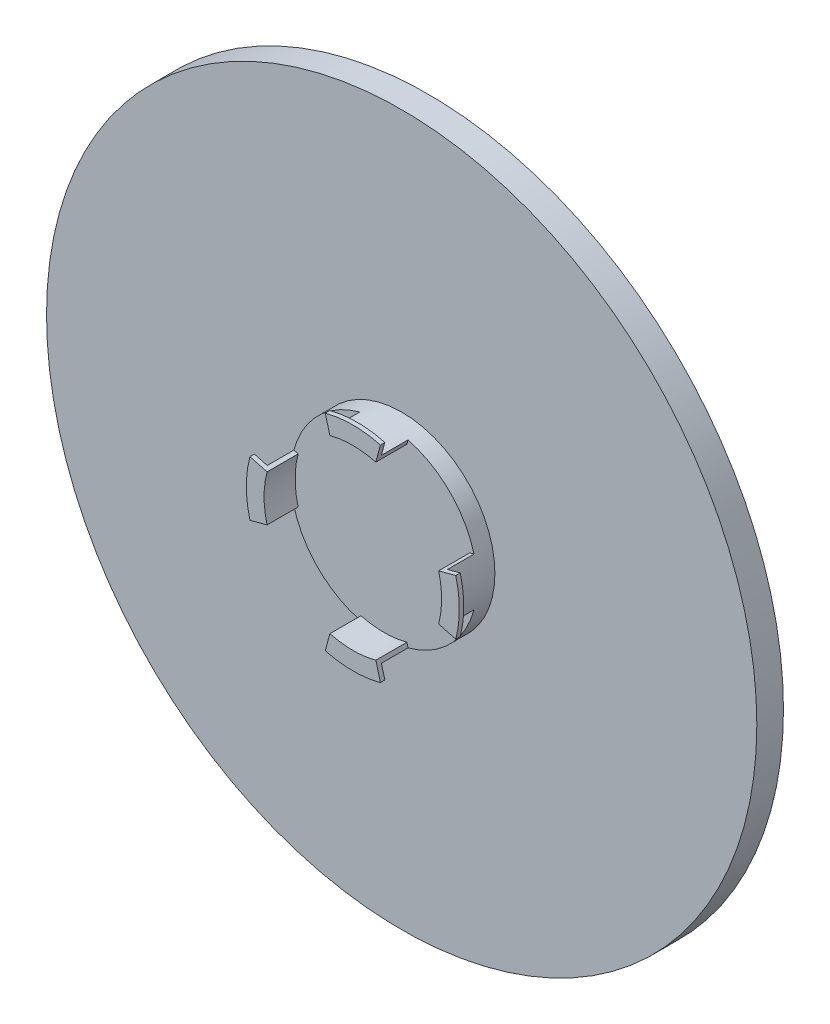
ISO-10303-21;
HEADER;
FILE_DESCRIPTION(('STEP AP214'),'2;1');
FILE_NAME('part.step','',(''),(''),'','','');
FILE_SCHEMA(('AUTOMOTIVE_DESIGN { 1 0 10303 214 1 1 1 1 }'));
ENDSEC;
DATA;
#1=APPLICATION_CONTEXT('core data for automotive mechanical design processes');
#2=APPLICATION_PROTOCOL_DEFINITION('international standard','automotive_design',2000,#1);
#3=PRODUCT_CONTEXT('',#1,'mechanical');
#4=PRODUCT('Part','Part','',(#3));
#5=PRODUCT_RELATED_PRODUCT_CATEGORY('part','',(#4));
#6=PRODUCT_DEFINITION_FORMATION('','',#4);
#7=PRODUCT_DEFINITION_CONTEXT('part definition',#1,'design');
#8=PRODUCT_DEFINITION('design','',#6,#7);
#9=PRODUCT_DEFINITION_SHAPE('','',#8);
#10=(LENGTH_UNIT() NAMED_UNIT(*) SI_UNIT(.MILLI.,.METRE.));
#11=(NAMED_UNIT(*) PLANE_ANGLE_UNIT() SI_UNIT($,.RADIAN.));
#12=(NAMED_UNIT(*) SI_UNIT($,.STERADIAN.) SOLID_ANGLE_UNIT());
#13=UNCERTAINTY_MEASURE_WITH_UNIT(LENGTH_MEASURE(1.E-05),#10,'distance_accuracy_value','');
#14=(GEOMETRIC_REPRESENTATION_CONTEXT(3) GLOBAL_UNCERTAINTY_ASSIGNED_CONTEXT((#13)) GLOBAL_UNIT_ASSIGNED_CONTEXT((#10,
#11,#12)) REPRESENTATION_CONTEXT('',''));
#15=CARTESIAN_POINT('',(0.,0.,0.));
#16=DIRECTION('',(0.,0.,1.));
#17=DIRECTION('',(1.,0.,0.));
#18=AXIS2_PLACEMENT_3D('',#15,#16,#17);
#19=CARTESIAN_POINT('',(0.,0.,50.));
#20=DIRECTION('',(0.,0.,1.));
#21=DIRECTION('',(1.,0.,0.));
#22=AXIS2_PLACEMENT_3D('',#19,#20,#21);
#23=PLANE('',#22);
#24=CARTESIAN_POINT('',(0.,0.,50.));
#25=DIRECTION('',(0.,0.,-1.));
#26=DIRECTION('',(1.,0.,0.));
#27=AXIS2_PLACEMENT_3D('',#24,#25,#26);
#28=CIRCLE('',#27,100.);
#29=CARTESIAN_POINT('',(25.8819045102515,-96.592582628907,50.));
#30=VERTEX_POINT('',#29);
#31=CARTESIAN_POINT('',(-25.8819045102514,-96.592582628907,50.));
#32=VERTEX_POINT('',#31);
#33=EDGE_CURVE('E48',#30,#32,#28,.T.);
#34=ORIENTED_EDGE('',*,*,#33,.F.);
#35=DIRECTION('',(-0.258819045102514,0.96592582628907,0.));
#36=VECTOR('',#35,1.);
#37=CARTESIAN_POINT('',(25.8819045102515,-96.592582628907,50.));
#38=LINE('',#37,#36);
#39=CARTESIAN_POINT('',(27.1759997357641,-101.422211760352,50.));
#40=VERTEX_POINT('',#39);
#41=EDGE_CURVE('E300',#40,#30,#38,.T.);
#42=ORIENTED_EDGE('',*,*,#41,.F.);
#43=CARTESIAN_POINT('',(0.,0.,50.));
#44=DIRECTION('',(0.,0.,1.));
#45=DIRECTION('',(1.,0.,0.));
#46=AXIS2_PLACEMENT_3D('',#43,#44,#45);
#47=CIRCLE('',#46,105.);
#48=CARTESIAN_POINT('',(101.422211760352,-27.1759997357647,50.));
#49=VERTEX_POINT('',#48);
#50=EDGE_CURVE('E34',#40,#49,#47,.T.);
#51=ORIENTED_EDGE('',*,*,#50,.T.);
#52=DIRECTION('',(0.965925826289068,-0.258819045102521,0.));
#53=VECTOR('',#52,1.);
#54=CARTESIAN_POINT('',(96.5925826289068,-25.8819045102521,50.));
#55=LINE('',#54,#53);
#56=CARTESIAN_POINT('',(96.5925826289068,-25.8819045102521,50.));
#57=VERTEX_POINT('',#56);
#58=EDGE_CURVE('E318',#57,#49,#55,.T.);
#59=ORIENTED_EDGE('',*,*,#58,.F.);
#60=CARTESIAN_POINT('',(0.,0.,50.));
#61=DIRECTION('',(0.,0.,-1.));
#62=DIRECTION('',(1.,0.,0.));
#63=AXIS2_PLACEMENT_3D('',#60,#61,#62);
#64=CIRCLE('',#63,100.);
#65=CARTESIAN_POINT('',(96.5925826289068,25.8819045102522,50.));
#66=VERTEX_POINT('',#65);
#67=EDGE_CURVE('E321',#66,#57,#64,.T.);
#68=ORIENTED_EDGE('',*,*,#67,.F.);
#69=DIRECTION('',(-0.965925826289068,-0.258819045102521,0.));
#70=VECTOR('',#69,1.);
#71=CARTESIAN_POINT('',(96.5925826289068,25.8819045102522,50.));
#72=LINE('',#71,#70);
#73=CARTESIAN_POINT('',(101.422211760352,27.1759997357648,50.));
#74=VERTEX_POINT('',#73);
#75=EDGE_CURVE('E313',#74,#66,#72,.T.);
#76=ORIENTED_EDGE('',*,*,#75,.F.);
#77=CARTESIAN_POINT('',(27.1759997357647,101.422211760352,50.));
#78=VERTEX_POINT('',#77);
#79=EDGE_CURVE('E391',#74,#78,#47,.T.);
#80=ORIENTED_EDGE('',*,*,#79,.T.);
#81=DIRECTION('',(0.258819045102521,0.965925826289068,0.));
#82=VECTOR('',#81,1.);
#83=CARTESIAN_POINT('',(25.8819045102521,96.5925826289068,50.));
#84=LINE('',#83,#82);
#85=CARTESIAN_POINT('',(25.8819045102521,96.5925826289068,50.));
#86=VERTEX_POINT('',#85);
#87=EDGE_CURVE('E342',#86,#78,#84,.T.);
#88=ORIENTED_EDGE('',*,*,#87,.F.);
#89=CARTESIAN_POINT('',(0.,0.,50.));
#90=DIRECTION('',(0.,0.,-1.));
#91=DIRECTION('',(1.,0.,0.));
#92=AXIS2_PLACEMENT_3D('',#89,#90,#91);
#93=CIRCLE('',#92,100.);
#94=CARTESIAN_POINT('',(-25.8819045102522,96.5925826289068,50.));
#95=VERTEX_POINT('',#94);
#96=EDGE_CURVE('E344',#95,#86,#93,.T.);
#97=ORIENTED_EDGE('',*,*,#96,.F.);
#98=DIRECTION('',(0.258819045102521,-0.965925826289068,0.));
#99=VECTOR('',#98,1.);
#100=CARTESIAN_POINT('',(-25.8819045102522,96.5925826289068,50.));
#101=LINE('',#100,#99);
#102=CARTESIAN_POINT('',(-27.1759997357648,101.422211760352,50.));
#103=VERTEX_POINT('',#102);
#104=EDGE_CURVE('E337',#103,#95,#101,.T.);
#105=ORIENTED_EDGE('',*,*,#104,.F.);
#106=CARTESIAN_POINT('',(-101.422211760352,27.175999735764,50.));
#107=VERTEX_POINT('',#106);
#108=EDGE_CURVE('E390',#103,#107,#47,.T.);
#109=ORIENTED_EDGE('',*,*,#108,.T.);
#110=DIRECTION('',(-0.96592582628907,0.258819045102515,0.));
#111=VECTOR('',#110,1.);
#112=CARTESIAN_POINT('',(-96.592582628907,25.8819045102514,50.));
#113=LINE('',#112,#111);
#114=CARTESIAN_POINT('',(-96.592582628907,25.8819045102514,50.));
#115=VERTEX_POINT('',#114);
#116=EDGE_CURVE('E366',#115,#107,#113,.T.);
#117=ORIENTED_EDGE('',*,*,#116,.F.);
#118=CARTESIAN_POINT('',(0.,0.,50.));
#119=DIRECTION('',(0.,0.,-1.));
#120=DIRECTION('',(1.,0.,0.));
#121=AXIS2_PLACEMENT_3D('',#118,#119,#120);
#122=CIRCLE('',#121,100.);
#123=CARTESIAN_POINT('',(-96.592582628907,-25.8819045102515,50.));
#124=VERTEX_POINT('',#123);
#125=EDGE_CURVE('E358',#124,#115,#122,.T.);
#126=ORIENTED_EDGE('',*,*,#125,.F.);
#127=DIRECTION('',(0.96592582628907,0.258819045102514,0.));
#128=VECTOR('',#127,1.);
#129=CARTESIAN_POINT('',(-96.592582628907,-25.8819045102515,50.));
#130=LINE('',#129,#128);
#131=CARTESIAN_POINT('',(-101.422211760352,-27.175999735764,50.));
#132=VERTEX_POINT('',#131);
#133=EDGE_CURVE('E363',#132,#124,#130,.T.);
#134=ORIENTED_EDGE('',*,*,#133,.F.);
#135=CARTESIAN_POINT('',(-27.175999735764,-101.422211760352,50.));
#136=VERTEX_POINT('',#135);
#137=EDGE_CURVE('E374',#132,#136,#47,.T.);
#138=ORIENTED_EDGE('',*,*,#137,.T.);
#139=DIRECTION('',(-0.258819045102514,-0.96592582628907,0.));
#140=VECTOR('',#139,1.);
#141=CARTESIAN_POINT('',(-25.8819045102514,-96.592582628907,50.));
#142=LINE('',#141,#140);
#143=EDGE_CURVE('E53',#32,#136,#142,.T.);
#144=ORIENTED_EDGE('',*,*,#143,.F.);
#145=EDGE_LOOP('',(#34,#42,#51,#59,#68,#76,#80,#88,#97,#105,#109,#117,#126,#134,#138,#144));
#146=FACE_BOUND('',#145,.T.);
#147=ADVANCED_FACE('F30',(#146),#23,.T.);
#148=CARTESIAN_POINT('',(0.,0.,30.));
#149=DIRECTION('',(0.,0.,1.));
#150=DIRECTION('',(1.,0.,0.));
#151=AXIS2_PLACEMENT_3D('',#148,#149,#150);
#152=PLANE('',#151);
#153=CARTESIAN_POINT('',(0.,0.,30.));
#154=DIRECTION('',(0.,0.,1.));
#155=DIRECTION('',(1.,0.,0.));
#156=AXIS2_PLACEMENT_3D('',#153,#154,#155);
#157=CIRCLE('',#156,400.);
#158=CARTESIAN_POINT('',(400.,0.,30.));
#159=VERTEX_POINT('',#158);
#160=EDGE_CURVE('E11',#159,#159,#157,.T.);
#161=ORIENTED_EDGE('',*,*,#160,.T.);
#162=EDGE_LOOP('',(#161));
#163=FACE_BOUND('',#162,.T.);
#164=CARTESIAN_POINT('',(0.,0.,30.));
#165=DIRECTION('',(0.,0.,1.));
#166=DIRECTION('',(1.,0.,0.));
#167=AXIS2_PLACEMENT_3D('',#164,#165,#166);
#168=CIRCLE('',#167,105.);
#169=CARTESIAN_POINT('',(105.,0.,30.));
#170=VERTEX_POINT('',#169);
#171=EDGE_CURVE('E392',#170,#170,#168,.T.);
#172=ORIENTED_EDGE('',*,*,#171,.F.);
#173=EDGE_LOOP('',(#172));
#174=FACE_BOUND('',#173,.T.);
#175=ADVANCED_FACE('F443',(#163,#174),#152,.T.);
#176=CARTESIAN_POINT('',(0.,0.,30.));
#177=DIRECTION('',(0.,0.,-1.));
#178=DIRECTION('',(-1.,0.,0.));
#179=AXIS2_PLACEMENT_3D('',#176,#177,#178);
#180=CYLINDRICAL_SURFACE('',#179,400.);
#181=ORIENTED_EDGE('',*,*,#160,.F.);
#182=EDGE_LOOP('',(#181));
#183=FACE_BOUND('',#182,.T.);
#184=CARTESIAN_POINT('',(0.,0.,0.));
#185=DIRECTION('',(0.,0.,1.));
#186=DIRECTION('',(1.,0.,0.));
#187=AXIS2_PLACEMENT_3D('',#184,#185,#186);
#188=CIRCLE('',#187,400.);
#189=CARTESIAN_POINT('',(400.,0.,0.));
#190=VERTEX_POINT('',#189);
#191=EDGE_CURVE('E40',#190,#190,#188,.T.);
#192=ORIENTED_EDGE('',*,*,#191,.T.);
#193=EDGE_LOOP('',(#192));
#194=FACE_BOUND('',#193,.T.);
#195=ADVANCED_FACE('F32',(#183,#194),#180,.T.);
#196=CARTESIAN_POINT('',(0.,0.,0.));
#197=DIRECTION('',(0.,0.,1.));
#198=DIRECTION('',(1.,0.,0.));
#199=AXIS2_PLACEMENT_3D('',#196,#197,#198);
#200=PLANE('',#199);
#201=ORIENTED_EDGE('',*,*,#191,.F.);
#202=EDGE_LOOP('',(#201));
#203=FACE_BOUND('',#202,.T.);
#204=ADVANCED_FACE('F454',(#203),#200,.F.);
#205=CARTESIAN_POINT('',(0.,0.,50.));
#206=DIRECTION('',(0.,0.,-1.));
#207=DIRECTION('',(-1.,0.,0.));
#208=AXIS2_PLACEMENT_3D('',#205,#206,#207);
#209=CYLINDRICAL_SURFACE('',#208,105.);
#210=ORIENTED_EDGE('',*,*,#137,.F.);
#211=DIRECTION('',(0.,0.,-1.));
#212=VECTOR('',#211,1.);
#213=CARTESIAN_POINT('',(-101.422211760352,-27.175999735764,80.));
#214=LINE('',#213,#212);
#215=CARTESIAN_POINT('',(-101.422211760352,-27.175999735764,80.));
#216=VERTEX_POINT('',#215);
#217=EDGE_CURVE('E379',#216,#132,#214,.T.);
#218=ORIENTED_EDGE('',*,*,#217,.F.);
#219=CARTESIAN_POINT('',(0.,0.,80.));
#220=DIRECTION('',(0.,0.,1.));
#221=DIRECTION('',(1.,0.,0.));
#222=AXIS2_PLACEMENT_3D('',#219,#220,#221);
#223=CIRCLE('',#222,105.);
#224=CARTESIAN_POINT('',(-101.422211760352,27.175999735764,80.));
#225=VERTEX_POINT('',#224);
#226=EDGE_CURVE('E359',#225,#216,#223,.T.);
#227=ORIENTED_EDGE('',*,*,#226,.F.);
#228=DIRECTION('',(0.,0.,-1.));
#229=VECTOR('',#228,1.);
#230=CARTESIAN_POINT('',(-101.422211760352,27.175999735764,80.));
#231=LINE('',#230,#229);
#232=EDGE_CURVE('E375',#225,#107,#231,.T.);
#233=ORIENTED_EDGE('',*,*,#232,.T.);
#234=ORIENTED_EDGE('',*,*,#108,.F.);
#235=DIRECTION('',(0.,0.,-1.));
#236=VECTOR('',#235,1.);
#237=CARTESIAN_POINT('',(-27.1759997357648,101.422211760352,80.));
#238=LINE('',#237,#236);
#239=CARTESIAN_POINT('',(-27.1759997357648,101.422211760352,80.));
#240=VERTEX_POINT('',#239);
#241=EDGE_CURVE('E356',#240,#103,#238,.T.);
#242=ORIENTED_EDGE('',*,*,#241,.F.);
#243=CARTESIAN_POINT('',(0.,0.,80.));
#244=DIRECTION('',(0.,0.,1.));
#245=DIRECTION('',(1.,0.,0.));
#246=AXIS2_PLACEMENT_3D('',#243,#244,#245);
#247=CIRCLE('',#246,105.);
#248=CARTESIAN_POINT('',(27.1759997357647,101.422211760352,80.));
#249=VERTEX_POINT('',#248);
#250=EDGE_CURVE('E338',#249,#240,#247,.T.);
#251=ORIENTED_EDGE('',*,*,#250,.F.);
#252=DIRECTION('',(0.,0.,-1.));
#253=VECTOR('',#252,1.);
#254=CARTESIAN_POINT('',(27.1759997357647,101.422211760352,80.));
#255=LINE('',#254,#253);
#256=EDGE_CURVE('E341',#249,#78,#255,.T.);
#257=ORIENTED_EDGE('',*,*,#256,.T.);
#258=ORIENTED_EDGE('',*,*,#79,.F.);
#259=DIRECTION('',(0.,0.,-1.));
#260=VECTOR('',#259,1.);
#261=CARTESIAN_POINT('',(101.422211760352,27.1759997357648,80.));
#262=LINE('',#261,#260);
#263=CARTESIAN_POINT('',(101.422211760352,27.1759997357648,80.));
#264=VERTEX_POINT('',#263);
#265=EDGE_CURVE('E334',#264,#74,#262,.T.);
#266=ORIENTED_EDGE('',*,*,#265,.F.);
#267=CARTESIAN_POINT('',(0.,0.,80.));
#268=DIRECTION('',(0.,0.,1.));
#269=DIRECTION('',(1.,0.,0.));
#270=AXIS2_PLACEMENT_3D('',#267,#268,#269);
#271=CIRCLE('',#270,105.);
#272=CARTESIAN_POINT('',(101.422211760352,-27.1759997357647,80.));
#273=VERTEX_POINT('',#272);
#274=EDGE_CURVE('E314',#273,#264,#271,.T.);
#275=ORIENTED_EDGE('',*,*,#274,.F.);
#276=DIRECTION('',(0.,0.,-1.));
#277=VECTOR('',#276,1.);
#278=CARTESIAN_POINT('',(101.422211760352,-27.1759997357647,80.));
#279=LINE('',#278,#277);
#280=EDGE_CURVE('E317',#273,#49,#279,.T.);
#281=ORIENTED_EDGE('',*,*,#280,.T.);
#282=ORIENTED_EDGE('',*,*,#50,.F.);
#283=DIRECTION('',(0.,0.,-1.));
#284=VECTOR('',#283,1.);
#285=CARTESIAN_POINT('',(27.1759997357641,-101.422211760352,80.));
#286=LINE('',#285,#284);
#287=CARTESIAN_POINT('',(27.1759997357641,-101.422211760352,80.));
#288=VERTEX_POINT('',#287);
#289=EDGE_CURVE('E310',#288,#40,#286,.T.);
#290=ORIENTED_EDGE('',*,*,#289,.F.);
#291=CARTESIAN_POINT('',(0.,0.,80.));
#292=DIRECTION('',(0.,0.,1.));
#293=DIRECTION('',(1.,0.,0.));
#294=AXIS2_PLACEMENT_3D('',#291,#292,#293);
#295=CIRCLE('',#294,105.);
#296=CARTESIAN_POINT('',(-27.175999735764,-101.422211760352,80.));
#297=VERTEX_POINT('',#296);
#298=EDGE_CURVE('E301',#297,#288,#295,.T.);
#299=ORIENTED_EDGE('',*,*,#298,.F.);
#300=DIRECTION('',(0.,0.,-1.));
#301=VECTOR('',#300,1.);
#302=CARTESIAN_POINT('',(-27.175999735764,-101.422211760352,80.));
#303=LINE('',#302,#301);
#304=EDGE_CURVE('E201',#297,#136,#303,.T.);
#305=ORIENTED_EDGE('',*,*,#304,.T.);
#306=EDGE_LOOP('',(#210,#218,#227,#233,#234,#242,#251,#257,#258,#266,#275,#281,#282,#290,#299,#305));
#307=FACE_BOUND('',#306,.T.);
#308=ORIENTED_EDGE('',*,*,#171,.T.);
#309=EDGE_LOOP('',(#308));
#310=FACE_BOUND('',#309,.T.);
#311=ADVANCED_FACE('F417',(#307,#310),#209,.T.);
#312=CARTESIAN_POINT('',(0.,0.,80.));
#313=DIRECTION('',(0.,0.,-1.));
#314=DIRECTION('',(-1.,0.,0.));
#315=AXIS2_PLACEMENT_3D('',#312,#313,#314);
#316=CYLINDRICAL_SURFACE('',#315,100.);
#317=ORIENTED_EDGE('',*,*,#125,.T.);
#318=DIRECTION('',(0.,0.,-1.));
#319=VECTOR('',#318,1.);
#320=CARTESIAN_POINT('',(-96.592582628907,25.8819045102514,80.));
#321=LINE('',#320,#319);
#322=CARTESIAN_POINT('',(-96.592582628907,25.8819045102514,85.));
#323=VERTEX_POINT('',#322);
#324=EDGE_CURVE('E378',#323,#115,#321,.T.);
#325=ORIENTED_EDGE('',*,*,#324,.F.);
#326=CARTESIAN_POINT('',(0.,0.,85.));
#327=DIRECTION('',(0.,0.,-1.));
#328=DIRECTION('',(1.,0.,0.));
#329=AXIS2_PLACEMENT_3D('',#326,#327,#328);
#330=CIRCLE('',#329,100.);
#331=CARTESIAN_POINT('',(-96.592582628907,-25.8819045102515,85.));
#332=VERTEX_POINT('',#331);
#333=EDGE_CURVE('E232',#332,#323,#330,.T.);
#334=ORIENTED_EDGE('',*,*,#333,.F.);
#335=DIRECTION('',(0.,0.,-1.));
#336=VECTOR('',#335,1.);
#337=CARTESIAN_POINT('',(-96.592582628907,-25.8819045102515,80.));
#338=LINE('',#337,#336);
#339=EDGE_CURVE('E362',#332,#124,#338,.T.);
#340=ORIENTED_EDGE('',*,*,#339,.T.);
#341=EDGE_LOOP('',(#317,#325,#334,#340));
#342=FACE_BOUND('',#341,.T.);
#343=ADVANCED_FACE('F409',(#342),#316,.F.);
#344=CARTESIAN_POINT('',(-96.592582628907,25.8819045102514,80.));
#345=DIRECTION('',(-0.258819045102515,-0.96592582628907,0.));
#346=DIRECTION('',(0.96592582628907,-0.258819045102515,0.));
#347=AXIS2_PLACEMENT_3D('',#344,#345,#346);
#348=PLANE('',#347);
#349=ORIENTED_EDGE('',*,*,#116,.T.);
#350=ORIENTED_EDGE('',*,*,#232,.F.);
#351=DIRECTION('',(-0.96592582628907,0.258819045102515,0.));
#352=VECTOR('',#351,1.);
#353=CARTESIAN_POINT('',(-96.592582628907,25.8819045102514,80.));
#354=LINE('',#353,#352);
#355=CARTESIAN_POINT('',(-115.911099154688,31.0582854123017,80.));
#356=VERTEX_POINT('',#355);
#357=EDGE_CURVE('E231',#225,#356,#354,.T.);
#358=ORIENTED_EDGE('',*,*,#357,.T.);
#359=DIRECTION('',(0.,0.,-1.));
#360=VECTOR('',#359,1.);
#361=CARTESIAN_POINT('',(-115.911099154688,31.0582854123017,85.));
#362=LINE('',#361,#360);
#363=CARTESIAN_POINT('',(-115.911099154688,31.0582854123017,85.));
#364=VERTEX_POINT('',#363);
#365=EDGE_CURVE('E251',#364,#356,#362,.T.);
#366=ORIENTED_EDGE('',*,*,#365,.F.);
#367=DIRECTION('',(-0.96592582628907,0.258819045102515,0.));
#368=VECTOR('',#367,1.);
#369=CARTESIAN_POINT('',(-96.592582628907,25.8819045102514,85.));
#370=LINE('',#369,#368);
#371=EDGE_CURVE('E235',#323,#364,#370,.T.);
#372=ORIENTED_EDGE('',*,*,#371,.F.);
#373=ORIENTED_EDGE('',*,*,#324,.T.);
#374=EDGE_LOOP('',(#349,#350,#358,#366,#372,#373));
#375=FACE_BOUND('',#374,.T.);
#376=ADVANCED_FACE('F404',(#375),#348,.F.);
#377=CARTESIAN_POINT('',(-96.592582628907,-25.8819045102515,80.));
#378=DIRECTION('',(-0.258819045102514,0.96592582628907,0.));
#379=DIRECTION('',(-0.96592582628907,-0.258819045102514,0.));
#380=AXIS2_PLACEMENT_3D('',#377,#378,#379);
#381=PLANE('',#380);
#382=ORIENTED_EDGE('',*,*,#133,.T.);
#383=ORIENTED_EDGE('',*,*,#339,.F.);
#384=DIRECTION('',(0.96592582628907,0.258819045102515,0.));
#385=VECTOR('',#384,1.);
#386=CARTESIAN_POINT('',(-96.592582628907,-25.8819045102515,85.));
#387=LINE('',#386,#385);
#388=CARTESIAN_POINT('',(-115.911099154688,-31.0582854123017,85.));
#389=VERTEX_POINT('',#388);
#390=EDGE_CURVE('E240',#389,#332,#387,.T.);
#391=ORIENTED_EDGE('',*,*,#390,.F.);
#392=DIRECTION('',(0.,0.,-1.));
#393=VECTOR('',#392,1.);
#394=CARTESIAN_POINT('',(-115.911099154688,-31.0582854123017,85.));
#395=LINE('',#394,#393);
#396=CARTESIAN_POINT('',(-115.911099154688,-31.0582854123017,80.));
#397=VERTEX_POINT('',#396);
#398=EDGE_CURVE('E243',#389,#397,#395,.T.);
#399=ORIENTED_EDGE('',*,*,#398,.T.);
#400=DIRECTION('',(0.96592582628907,0.258819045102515,0.));
#401=VECTOR('',#400,1.);
#402=CARTESIAN_POINT('',(-96.592582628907,-25.8819045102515,80.));
#403=LINE('',#402,#401);
#404=EDGE_CURVE('E236',#397,#216,#403,.T.);
#405=ORIENTED_EDGE('',*,*,#404,.T.);
#406=ORIENTED_EDGE('',*,*,#217,.T.);
#407=EDGE_LOOP('',(#382,#383,#391,#399,#405,#406));
#408=FACE_BOUND('',#407,.T.);
#409=ADVANCED_FACE('F412',(#408),#381,.F.);
#410=CARTESIAN_POINT('',(-25.8819045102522,96.5925826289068,80.));
#411=DIRECTION('',(0.965925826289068,0.258819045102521,0.));
#412=DIRECTION('',(-0.258819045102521,0.965925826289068,0.));
#413=AXIS2_PLACEMENT_3D('',#410,#411,#412);
#414=PLANE('',#413);
#415=ORIENTED_EDGE('',*,*,#104,.T.);
#416=DIRECTION('',(0.,0.,-1.));
#417=VECTOR('',#416,1.);
#418=CARTESIAN_POINT('',(-25.8819045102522,96.5925826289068,80.));
#419=LINE('',#418,#417);
#420=CARTESIAN_POINT('',(-25.8819045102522,96.5925826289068,85.));
#421=VERTEX_POINT('',#420);
#422=EDGE_CURVE('E353',#421,#95,#419,.T.);
#423=ORIENTED_EDGE('',*,*,#422,.F.);
#424=DIRECTION('',(0.258819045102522,-0.965925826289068,0.));
#425=VECTOR('',#424,1.);
#426=CARTESIAN_POINT('',(-25.8819045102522,96.5925826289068,85.));
#427=LINE('',#426,#425);
#428=CARTESIAN_POINT('',(-31.0582854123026,115.911099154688,85.));
#429=VERTEX_POINT('',#428);
#430=EDGE_CURVE('E286',#429,#421,#427,.T.);
#431=ORIENTED_EDGE('',*,*,#430,.F.);
#432=DIRECTION('',(0.,0.,-1.));
#433=VECTOR('',#432,1.);
#434=CARTESIAN_POINT('',(-31.0582854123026,115.911099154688,85.));
#435=LINE('',#434,#433);
#436=CARTESIAN_POINT('',(-31.0582854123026,115.911099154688,80.));
#437=VERTEX_POINT('',#436);
#438=EDGE_CURVE('E289',#429,#437,#435,.T.);
#439=ORIENTED_EDGE('',*,*,#438,.T.);
#440=DIRECTION('',(0.258819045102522,-0.965925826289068,0.));
#441=VECTOR('',#440,1.);
#442=CARTESIAN_POINT('',(-25.8819045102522,96.5925826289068,80.));
#443=LINE('',#442,#441);
#444=EDGE_CURVE('E282',#437,#240,#443,.T.);
#445=ORIENTED_EDGE('',*,*,#444,.T.);
#446=ORIENTED_EDGE('',*,*,#241,.T.);
#447=EDGE_LOOP('',(#415,#423,#431,#439,#445,#446));
#448=FACE_BOUND('',#447,.T.);
#449=ADVANCED_FACE('F513',(#448),#414,.F.);
#450=CARTESIAN_POINT('',(0.,0.,80.));
#451=DIRECTION('',(0.,0.,-1.));
#452=DIRECTION('',(-1.,0.,0.));
#453=AXIS2_PLACEMENT_3D('',#450,#451,#452);
#454=CYLINDRICAL_SURFACE('',#453,100.);
#455=ORIENTED_EDGE('',*,*,#96,.T.);
#456=DIRECTION('',(0.,0.,-1.));
#457=VECTOR('',#456,1.);
#458=CARTESIAN_POINT('',(25.8819045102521,96.5925826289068,80.));
#459=LINE('',#458,#457);
#460=CARTESIAN_POINT('',(25.8819045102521,96.5925826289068,85.));
#461=VERTEX_POINT('',#460);
#462=EDGE_CURVE('E351',#461,#86,#459,.T.);
#463=ORIENTED_EDGE('',*,*,#462,.F.);
#464=CARTESIAN_POINT('',(0.,0.,85.));
#465=DIRECTION('',(0.,0.,-1.));
#466=DIRECTION('',(1.,0.,0.));
#467=AXIS2_PLACEMENT_3D('',#464,#465,#466);
#468=CIRCLE('',#467,100.);
#469=EDGE_CURVE('E278',#421,#461,#468,.T.);
#470=ORIENTED_EDGE('',*,*,#469,.F.);
#471=ORIENTED_EDGE('',*,*,#422,.T.);
#472=EDGE_LOOP('',(#455,#463,#470,#471));
#473=FACE_BOUND('',#472,.T.);
#474=ADVANCED_FACE('F523',(#473),#454,.F.);
#475=CARTESIAN_POINT('',(25.8819045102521,96.5925826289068,80.));
#476=DIRECTION('',(-0.965925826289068,0.258819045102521,0.));
#477=DIRECTION('',(-0.258819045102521,-0.965925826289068,0.));
#478=AXIS2_PLACEMENT_3D('',#475,#476,#477);
#479=PLANE('',#478);
#480=ORIENTED_EDGE('',*,*,#87,.T.);
#481=ORIENTED_EDGE('',*,*,#256,.F.);
#482=DIRECTION('',(0.258819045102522,0.965925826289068,0.));
#483=VECTOR('',#482,1.);
#484=CARTESIAN_POINT('',(25.8819045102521,96.5925826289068,80.));
#485=LINE('',#484,#483);
#486=CARTESIAN_POINT('',(31.0582854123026,115.911099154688,80.));
#487=VERTEX_POINT('',#486);
#488=EDGE_CURVE('E277',#249,#487,#485,.T.);
#489=ORIENTED_EDGE('',*,*,#488,.T.);
#490=DIRECTION('',(0.,0.,-1.));
#491=VECTOR('',#490,1.);
#492=CARTESIAN_POINT('',(31.0582854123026,115.911099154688,85.));
#493=LINE('',#492,#491);
#494=CARTESIAN_POINT('',(31.0582854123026,115.911099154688,85.));
#495=VERTEX_POINT('',#494);
#496=EDGE_CURVE('E297',#495,#487,#493,.T.);
#497=ORIENTED_EDGE('',*,*,#496,.F.);
#498=DIRECTION('',(0.258819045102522,0.965925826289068,0.));
#499=VECTOR('',#498,1.);
#500=CARTESIAN_POINT('',(25.8819045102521,96.5925826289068,85.));
#501=LINE('',#500,#499);
#502=EDGE_CURVE('E281',#461,#495,#501,.T.);
#503=ORIENTED_EDGE('',*,*,#502,.F.);
#504=ORIENTED_EDGE('',*,*,#462,.T.);
#505=EDGE_LOOP('',(#480,#481,#489,#497,#503,#504));
#506=FACE_BOUND('',#505,.T.);
#507=ADVANCED_FACE('F534',(#506),#479,.F.);
#508=CARTESIAN_POINT('',(96.5925826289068,25.8819045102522,80.));
#509=DIRECTION('',(0.258819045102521,-0.965925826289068,0.));
#510=DIRECTION('',(0.965925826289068,0.258819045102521,0.));
#511=AXIS2_PLACEMENT_3D('',#508,#509,#510);
#512=PLANE('',#511);
#513=ORIENTED_EDGE('',*,*,#75,.T.);
#514=DIRECTION('',(0.,0.,-1.));
#515=VECTOR('',#514,1.);
#516=CARTESIAN_POINT('',(96.5925826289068,25.8819045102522,80.));
#517=LINE('',#516,#515);
#518=CARTESIAN_POINT('',(96.5925826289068,25.8819045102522,85.));
#519=VERTEX_POINT('',#518);
#520=EDGE_CURVE('E331',#519,#66,#517,.T.);
#521=ORIENTED_EDGE('',*,*,#520,.F.);
#522=DIRECTION('',(-0.965925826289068,-0.258819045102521,0.));
#523=VECTOR('',#522,1.);
#524=CARTESIAN_POINT('',(96.5925826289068,25.8819045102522,85.));
#525=LINE('',#524,#523);
#526=CARTESIAN_POINT('',(115.911099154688,31.0582854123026,85.));
#527=VERTEX_POINT('',#526);
#528=EDGE_CURVE('E263',#527,#519,#525,.T.);
#529=ORIENTED_EDGE('',*,*,#528,.F.);
#530=DIRECTION('',(0.,0.,-1.));
#531=VECTOR('',#530,1.);
#532=CARTESIAN_POINT('',(115.911099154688,31.0582854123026,85.));
#533=LINE('',#532,#531);
#534=CARTESIAN_POINT('',(115.911099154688,31.0582854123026,80.));
#535=VERTEX_POINT('',#534);
#536=EDGE_CURVE('E266',#527,#535,#533,.T.);
#537=ORIENTED_EDGE('',*,*,#536,.T.);
#538=DIRECTION('',(-0.965925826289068,-0.258819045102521,0.));
#539=VECTOR('',#538,1.);
#540=CARTESIAN_POINT('',(96.5925826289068,25.8819045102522,80.));
#541=LINE('',#540,#539);
#542=EDGE_CURVE('E259',#535,#264,#541,.T.);
#543=ORIENTED_EDGE('',*,*,#542,.T.);
#544=ORIENTED_EDGE('',*,*,#265,.T.);
#545=EDGE_LOOP('',(#513,#521,#529,#537,#543,#544));
#546=FACE_BOUND('',#545,.T.);
#547=ADVANCED_FACE('F545',(#546),#512,.F.);
#548=CARTESIAN_POINT('',(0.,0.,80.));
#549=DIRECTION('',(0.,0.,-1.));
#550=DIRECTION('',(-1.,0.,0.));
#551=AXIS2_PLACEMENT_3D('',#548,#549,#550);
#552=CYLINDRICAL_SURFACE('',#551,100.);
#553=ORIENTED_EDGE('',*,*,#67,.T.);
#554=DIRECTION('',(0.,0.,-1.));
#555=VECTOR('',#554,1.);
#556=CARTESIAN_POINT('',(96.5925826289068,-25.8819045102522,80.));
#557=LINE('',#556,#555);
#558=CARTESIAN_POINT('',(96.5925826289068,-25.8819045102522,85.));
#559=VERTEX_POINT('',#558);
#560=EDGE_CURVE('E328',#559,#57,#557,.T.);
#561=ORIENTED_EDGE('',*,*,#560,.F.);
#562=CARTESIAN_POINT('',(0.,0.,85.));
#563=DIRECTION('',(0.,0.,-1.));
#564=DIRECTION('',(1.,0.,0.));
#565=AXIS2_PLACEMENT_3D('',#562,#563,#564);
#566=CIRCLE('',#565,100.);
#567=EDGE_CURVE('E255',#519,#559,#566,.T.);
#568=ORIENTED_EDGE('',*,*,#567,.F.);
#569=ORIENTED_EDGE('',*,*,#520,.T.);
#570=EDGE_LOOP('',(#553,#561,#568,#569));
#571=FACE_BOUND('',#570,.T.);
#572=ADVANCED_FACE('F556',(#571),#552,.F.);
#573=CARTESIAN_POINT('',(96.5925826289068,-25.8819045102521,80.));
#574=DIRECTION('',(0.258819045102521,0.965925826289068,0.));
#575=DIRECTION('',(-0.965925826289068,0.258819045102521,0.));
#576=AXIS2_PLACEMENT_3D('',#573,#574,#575);
#577=PLANE('',#576);
#578=ORIENTED_EDGE('',*,*,#58,.T.);
#579=ORIENTED_EDGE('',*,*,#280,.F.);
#580=DIRECTION('',(0.965925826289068,-0.258819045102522,0.));
#581=VECTOR('',#580,1.);
#582=CARTESIAN_POINT('',(96.5925826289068,-25.8819045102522,80.));
#583=LINE('',#582,#581);
#584=CARTESIAN_POINT('',(115.911099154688,-31.0582854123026,80.));
#585=VERTEX_POINT('',#584);
#586=EDGE_CURVE('E254',#273,#585,#583,.T.);
#587=ORIENTED_EDGE('',*,*,#586,.T.);
#588=DIRECTION('',(0.,0.,-1.));
#589=VECTOR('',#588,1.);
#590=CARTESIAN_POINT('',(115.911099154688,-31.0582854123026,85.));
#591=LINE('',#590,#589);
#592=CARTESIAN_POINT('',(115.911099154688,-31.0582854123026,85.));
#593=VERTEX_POINT('',#592);
#594=EDGE_CURVE('E274',#593,#585,#591,.T.);
#595=ORIENTED_EDGE('',*,*,#594,.F.);
#596=DIRECTION('',(0.965925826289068,-0.258819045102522,0.));
#597=VECTOR('',#596,1.);
#598=CARTESIAN_POINT('',(96.5925826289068,-25.8819045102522,85.));
#599=LINE('',#598,#597);
#600=EDGE_CURVE('E258',#559,#593,#599,.T.);
#601=ORIENTED_EDGE('',*,*,#600,.F.);
#602=ORIENTED_EDGE('',*,*,#560,.T.);
#603=EDGE_LOOP('',(#578,#579,#587,#595,#601,#602));
#604=FACE_BOUND('',#603,.T.);
#605=ADVANCED_FACE('F567',(#604),#577,.F.);
#606=CARTESIAN_POINT('',(25.8819045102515,-96.592582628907,80.));
#607=DIRECTION('',(-0.96592582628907,-0.258819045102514,0.));
#608=DIRECTION('',(0.258819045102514,-0.96592582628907,0.));
#609=AXIS2_PLACEMENT_3D('',#606,#607,#608);
#610=PLANE('',#609);
#611=ORIENTED_EDGE('',*,*,#41,.T.);
#612=DIRECTION('',(0.,0.,-1.));
#613=VECTOR('',#612,1.);
#614=CARTESIAN_POINT('',(25.8819045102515,-96.592582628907,80.));
#615=LINE('',#614,#613);
#616=CARTESIAN_POINT('',(25.8819045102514,-96.592582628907,85.));
#617=VERTEX_POINT('',#616);
#618=EDGE_CURVE('E200',#617,#30,#615,.T.);
#619=ORIENTED_EDGE('',*,*,#618,.F.);
#620=DIRECTION('',(-0.258819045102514,0.96592582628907,0.));
#621=VECTOR('',#620,1.);
#622=CARTESIAN_POINT('',(25.8819045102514,-96.592582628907,85.));
#623=LINE('',#622,#621);
#624=CARTESIAN_POINT('',(31.0582854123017,-115.911099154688,85.));
#625=VERTEX_POINT('',#624);
#626=EDGE_CURVE('E215',#625,#617,#623,.T.);
#627=ORIENTED_EDGE('',*,*,#626,.F.);
#628=DIRECTION('',(0.,0.,-1.));
#629=VECTOR('',#628,1.);
#630=CARTESIAN_POINT('',(31.0582854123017,-115.911099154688,85.));
#631=LINE('',#630,#629);
#632=CARTESIAN_POINT('',(31.0582854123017,-115.911099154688,80.));
#633=VERTEX_POINT('',#632);
#634=EDGE_CURVE('E224',#625,#633,#631,.T.);
#635=ORIENTED_EDGE('',*,*,#634,.T.);
#636=DIRECTION('',(-0.258819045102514,0.96592582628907,0.));
#637=VECTOR('',#636,1.);
#638=CARTESIAN_POINT('',(25.8819045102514,-96.592582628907,80.));
#639=LINE('',#638,#637);
#640=EDGE_CURVE('E216',#633,#288,#639,.T.);
#641=ORIENTED_EDGE('',*,*,#640,.T.);
#642=ORIENTED_EDGE('',*,*,#289,.T.);
#643=EDGE_LOOP('',(#611,#619,#627,#635,#641,#642));
#644=FACE_BOUND('',#643,.T.);
#645=ADVANCED_FACE('F578',(#644),#610,.F.);
#646=CARTESIAN_POINT('',(0.,0.,80.));
#647=DIRECTION('',(0.,0.,-1.));
#648=DIRECTION('',(-1.,0.,0.));
#649=AXIS2_PLACEMENT_3D('',#646,#647,#648);
#650=CYLINDRICAL_SURFACE('',#649,100.);
#651=ORIENTED_EDGE('',*,*,#33,.T.);
#652=DIRECTION('',(0.,0.,-1.));
#653=VECTOR('',#652,1.);
#654=CARTESIAN_POINT('',(-25.8819045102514,-96.592582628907,80.));
#655=LINE('',#654,#653);
#656=CARTESIAN_POINT('',(-25.8819045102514,-96.592582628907,85.));
#657=VERTEX_POINT('',#656);
#658=EDGE_CURVE('E193',#657,#32,#655,.T.);
#659=ORIENTED_EDGE('',*,*,#658,.F.);
#660=CARTESIAN_POINT('',(0.,0.,85.));
#661=DIRECTION('',(0.,0.,-1.));
#662=DIRECTION('',(1.,0.,0.));
#663=AXIS2_PLACEMENT_3D('',#660,#661,#662);
#664=CIRCLE('',#663,100.);
#665=EDGE_CURVE('E198',#617,#657,#664,.T.);
#666=ORIENTED_EDGE('',*,*,#665,.F.);
#667=ORIENTED_EDGE('',*,*,#618,.T.);
#668=EDGE_LOOP('',(#651,#659,#666,#667));
#669=FACE_BOUND('',#668,.T.);
#670=ADVANCED_FACE('F195',(#669),#650,.F.);
#671=CARTESIAN_POINT('',(-25.8819045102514,-96.592582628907,80.));
#672=DIRECTION('',(0.96592582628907,-0.258819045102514,0.));
#673=DIRECTION('',(0.258819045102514,0.96592582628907,0.));
#674=AXIS2_PLACEMENT_3D('',#671,#672,#673);
#675=PLANE('',#674);
#676=ORIENTED_EDGE('',*,*,#143,.T.);
#677=ORIENTED_EDGE('',*,*,#304,.F.);
#678=DIRECTION('',(-0.258819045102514,-0.96592582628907,0.));
#679=VECTOR('',#678,1.);
#680=CARTESIAN_POINT('',(-25.8819045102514,-96.592582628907,80.));
#681=LINE('',#680,#679);
#682=CARTESIAN_POINT('',(-31.0582854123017,-115.911099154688,80.));
#683=VERTEX_POINT('',#682);
#684=EDGE_CURVE('E225',#297,#683,#681,.T.);
#685=ORIENTED_EDGE('',*,*,#684,.T.);
#686=DIRECTION('',(0.,0.,-1.));
#687=VECTOR('',#686,1.);
#688=CARTESIAN_POINT('',(-31.0582854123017,-115.911099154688,85.));
#689=LINE('',#688,#687);
#690=CARTESIAN_POINT('',(-31.0582854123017,-115.911099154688,85.));
#691=VERTEX_POINT('',#690);
#692=EDGE_CURVE('E207',#691,#683,#689,.T.);
#693=ORIENTED_EDGE('',*,*,#692,.F.);
#694=DIRECTION('',(-0.258819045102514,-0.96592582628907,0.));
#695=VECTOR('',#694,1.);
#696=CARTESIAN_POINT('',(-25.8819045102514,-96.592582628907,85.));
#697=LINE('',#696,#695);
#698=EDGE_CURVE('E204',#657,#691,#697,.T.);
#699=ORIENTED_EDGE('',*,*,#698,.F.);
#700=ORIENTED_EDGE('',*,*,#658,.T.);
#701=EDGE_LOOP('',(#676,#677,#685,#693,#699,#700));
#702=FACE_BOUND('',#701,.T.);
#703=ADVANCED_FACE('F205',(#702),#675,.F.);
#704=CARTESIAN_POINT('',(0.,0.,80.));
#705=DIRECTION('',(0.,0.,1.));
#706=DIRECTION('',(1.,0.,0.));
#707=AXIS2_PLACEMENT_3D('',#704,#705,#706);
#708=PLANE('',#707);
#709=ORIENTED_EDGE('',*,*,#488,.F.);
#710=ORIENTED_EDGE('',*,*,#250,.T.);
#711=ORIENTED_EDGE('',*,*,#444,.F.);
#712=CARTESIAN_POINT('',(0.,0.,80.));
#713=DIRECTION('',(0.,0.,1.));
#714=DIRECTION('',(1.,0.,0.));
#715=AXIS2_PLACEMENT_3D('',#712,#713,#714);
#716=CIRCLE('',#715,120.);
#717=EDGE_CURVE('E291',#487,#437,#716,.T.);
#718=ORIENTED_EDGE('',*,*,#717,.F.);
#719=EDGE_LOOP('',(#709,#710,#711,#718));
#720=FACE_BOUND('',#719,.T.);
#721=ADVANCED_FACE('F608',(#720),#708,.F.);
#722=CARTESIAN_POINT('',(0.,0.,85.));
#723=DIRECTION('',(0.,0.,-1.));
#724=DIRECTION('',(-1.,0.,0.));
#725=AXIS2_PLACEMENT_3D('',#722,#723,#724);
#726=CYLINDRICAL_SURFACE('',#725,120.);
#727=ORIENTED_EDGE('',*,*,#717,.T.);
#728=ORIENTED_EDGE('',*,*,#438,.F.);
#729=CARTESIAN_POINT('',(0.,0.,85.));
#730=DIRECTION('',(0.,0.,1.));
#731=DIRECTION('',(1.,0.,0.));
#732=AXIS2_PLACEMENT_3D('',#729,#730,#731);
#733=CIRCLE('',#732,120.);
#734=EDGE_CURVE('E284',#495,#429,#733,.T.);
#735=ORIENTED_EDGE('',*,*,#734,.F.);
#736=ORIENTED_EDGE('',*,*,#496,.T.);
#737=EDGE_LOOP('',(#727,#728,#735,#736));
#738=FACE_BOUND('',#737,.T.);
#739=ADVANCED_FACE('F617',(#738),#726,.T.);
#740=CARTESIAN_POINT('',(0.,0.,85.));
#741=DIRECTION('',(0.,0.,1.));
#742=DIRECTION('',(1.,0.,0.));
#743=AXIS2_PLACEMENT_3D('',#740,#741,#742);
#744=PLANE('',#743);
#745=ORIENTED_EDGE('',*,*,#469,.T.);
#746=ORIENTED_EDGE('',*,*,#502,.T.);
#747=ORIENTED_EDGE('',*,*,#734,.T.);
#748=ORIENTED_EDGE('',*,*,#430,.T.);
#749=EDGE_LOOP('',(#745,#746,#747,#748));
#750=FACE_BOUND('',#749,.T.);
#751=ADVANCED_FACE('F627',(#750),#744,.T.);
#752=CARTESIAN_POINT('',(0.,0.,80.));
#753=DIRECTION('',(0.,0.,1.));
#754=DIRECTION('',(1.,0.,0.));
#755=AXIS2_PLACEMENT_3D('',#752,#753,#754);
#756=PLANE('',#755);
#757=ORIENTED_EDGE('',*,*,#586,.F.);
#758=ORIENTED_EDGE('',*,*,#274,.T.);
#759=ORIENTED_EDGE('',*,*,#542,.F.);
#760=CARTESIAN_POINT('',(0.,0.,80.));
#761=DIRECTION('',(0.,0.,1.));
#762=DIRECTION('',(1.,0.,0.));
#763=AXIS2_PLACEMENT_3D('',#760,#761,#762);
#764=CIRCLE('',#763,120.);
#765=EDGE_CURVE('E268',#585,#535,#764,.T.);
#766=ORIENTED_EDGE('',*,*,#765,.F.);
#767=EDGE_LOOP('',(#757,#758,#759,#766));
#768=FACE_BOUND('',#767,.T.);
#769=ADVANCED_FACE('F637',(#768),#756,.F.);
#770=CARTESIAN_POINT('',(0.,0.,85.));
#771=DIRECTION('',(0.,0.,-1.));
#772=DIRECTION('',(-1.,0.,0.));
#773=AXIS2_PLACEMENT_3D('',#770,#771,#772);
#774=CYLINDRICAL_SURFACE('',#773,120.);
#775=ORIENTED_EDGE('',*,*,#765,.T.);
#776=ORIENTED_EDGE('',*,*,#536,.F.);
#777=CARTESIAN_POINT('',(0.,0.,85.));
#778=DIRECTION('',(0.,0.,1.));
#779=DIRECTION('',(1.,0.,0.));
#780=AXIS2_PLACEMENT_3D('',#777,#778,#779);
#781=CIRCLE('',#780,120.);
#782=EDGE_CURVE('E261',#593,#527,#781,.T.);
#783=ORIENTED_EDGE('',*,*,#782,.F.);
#784=ORIENTED_EDGE('',*,*,#594,.T.);
#785=EDGE_LOOP('',(#775,#776,#783,#784));
#786=FACE_BOUND('',#785,.T.);
#787=ADVANCED_FACE('F647',(#786),#774,.T.);
#788=CARTESIAN_POINT('',(0.,0.,85.));
#789=DIRECTION('',(0.,0.,1.));
#790=DIRECTION('',(1.,0.,0.));
#791=AXIS2_PLACEMENT_3D('',#788,#789,#790);
#792=PLANE('',#791);
#793=ORIENTED_EDGE('',*,*,#567,.T.);
#794=ORIENTED_EDGE('',*,*,#600,.T.);
#795=ORIENTED_EDGE('',*,*,#782,.T.);
#796=ORIENTED_EDGE('',*,*,#528,.T.);
#797=EDGE_LOOP('',(#793,#794,#795,#796));
#798=FACE_BOUND('',#797,.T.);
#799=ADVANCED_FACE('F657',(#798),#792,.T.);
#800=CARTESIAN_POINT('',(0.,0.,80.));
#801=DIRECTION('',(0.,0.,1.));
#802=DIRECTION('',(1.,0.,0.));
#803=AXIS2_PLACEMENT_3D('',#800,#801,#802);
#804=PLANE('',#803);
#805=ORIENTED_EDGE('',*,*,#357,.F.);
#806=ORIENTED_EDGE('',*,*,#226,.T.);
#807=ORIENTED_EDGE('',*,*,#404,.F.);
#808=CARTESIAN_POINT('',(0.,0.,80.));
#809=DIRECTION('',(0.,0.,1.));
#810=DIRECTION('',(1.,0.,0.));
#811=AXIS2_PLACEMENT_3D('',#808,#809,#810);
#812=CIRCLE('',#811,120.);
#813=EDGE_CURVE('E245',#356,#397,#812,.T.);
#814=ORIENTED_EDGE('',*,*,#813,.F.);
#815=EDGE_LOOP('',(#805,#806,#807,#814));
#816=FACE_BOUND('',#815,.T.);
#817=ADVANCED_FACE('F421',(#816),#804,.F.);
#818=CARTESIAN_POINT('',(0.,0.,85.));
#819=DIRECTION('',(0.,0.,-1.));
#820=DIRECTION('',(-1.,0.,0.));
#821=AXIS2_PLACEMENT_3D('',#818,#819,#820);
#822=CYLINDRICAL_SURFACE('',#821,120.);
#823=ORIENTED_EDGE('',*,*,#813,.T.);
#824=ORIENTED_EDGE('',*,*,#398,.F.);
#825=CARTESIAN_POINT('',(0.,0.,85.));
#826=DIRECTION('',(0.,0.,1.));
#827=DIRECTION('',(1.,0.,0.));
#828=AXIS2_PLACEMENT_3D('',#825,#826,#827);
#829=CIRCLE('',#828,120.);
#830=EDGE_CURVE('E238',#364,#389,#829,.T.);
#831=ORIENTED_EDGE('',*,*,#830,.F.);
#832=ORIENTED_EDGE('',*,*,#365,.T.);
#833=EDGE_LOOP('',(#823,#824,#831,#832));
#834=FACE_BOUND('',#833,.T.);
#835=ADVANCED_FACE('F425',(#834),#822,.T.);
#836=CARTESIAN_POINT('',(0.,0.,85.));
#837=DIRECTION('',(0.,0.,1.));
#838=DIRECTION('',(1.,0.,0.));
#839=AXIS2_PLACEMENT_3D('',#836,#837,#838);
#840=PLANE('',#839);
#841=ORIENTED_EDGE('',*,*,#333,.T.);
#842=ORIENTED_EDGE('',*,*,#371,.T.);
#843=ORIENTED_EDGE('',*,*,#830,.T.);
#844=ORIENTED_EDGE('',*,*,#390,.T.);
#845=EDGE_LOOP('',(#841,#842,#843,#844));
#846=FACE_BOUND('',#845,.T.);
#847=ADVANCED_FACE('F428',(#846),#840,.T.);
#848=CARTESIAN_POINT('',(0.,0.,80.));
#849=DIRECTION('',(0.,0.,1.));
#850=DIRECTION('',(1.,0.,0.));
#851=AXIS2_PLACEMENT_3D('',#848,#849,#850);
#852=PLANE('',#851);
#853=ORIENTED_EDGE('',*,*,#684,.F.);
#854=ORIENTED_EDGE('',*,*,#298,.T.);
#855=ORIENTED_EDGE('',*,*,#640,.F.);
#856=CARTESIAN_POINT('',(0.,0.,80.));
#857=DIRECTION('',(0.,0.,1.));
#858=DIRECTION('',(1.,0.,0.));
#859=AXIS2_PLACEMENT_3D('',#856,#857,#858);
#860=CIRCLE('',#859,120.);
#861=EDGE_CURVE('E219',#683,#633,#860,.T.);
#862=ORIENTED_EDGE('',*,*,#861,.F.);
#863=EDGE_LOOP('',(#853,#854,#855,#862));
#864=FACE_BOUND('',#863,.T.);
#865=ADVANCED_FACE('F430',(#864),#852,.F.);
#866=CARTESIAN_POINT('',(0.,0.,85.));
#867=DIRECTION('',(0.,0.,-1.));
#868=DIRECTION('',(-1.,0.,0.));
#869=AXIS2_PLACEMENT_3D('',#866,#867,#868);
#870=CYLINDRICAL_SURFACE('',#869,120.);
#871=ORIENTED_EDGE('',*,*,#861,.T.);
#872=ORIENTED_EDGE('',*,*,#634,.F.);
#873=CARTESIAN_POINT('',(0.,0.,85.));
#874=DIRECTION('',(0.,0.,1.));
#875=DIRECTION('',(1.,0.,0.));
#876=AXIS2_PLACEMENT_3D('',#873,#874,#875);
#877=CIRCLE('',#876,120.);
#878=EDGE_CURVE('E210',#691,#625,#877,.T.);
#879=ORIENTED_EDGE('',*,*,#878,.F.);
#880=ORIENTED_EDGE('',*,*,#692,.T.);
#881=EDGE_LOOP('',(#871,#872,#879,#880));
#882=FACE_BOUND('',#881,.T.);
#883=ADVANCED_FACE('F436',(#882),#870,.T.);
#884=CARTESIAN_POINT('',(0.,0.,85.));
#885=DIRECTION('',(0.,0.,1.));
#886=DIRECTION('',(1.,0.,0.));
#887=AXIS2_PLACEMENT_3D('',#884,#885,#886);
#888=PLANE('',#887);
#889=ORIENTED_EDGE('',*,*,#665,.T.);
#890=ORIENTED_EDGE('',*,*,#698,.T.);
#891=ORIENTED_EDGE('',*,*,#878,.T.);
#892=ORIENTED_EDGE('',*,*,#626,.T.);
#893=EDGE_LOOP('',(#889,#890,#891,#892));
#894=FACE_BOUND('',#893,.T.);
#895=ADVANCED_FACE('F213',(#894),#888,.T.);
#896=CLOSED_SHELL('',(#147,#175,#195,#204,#311,#343,#376,#409,#449,#474,#507,#547,#572,#605,
#645,#670,#703,#721,#739,#751,#769,#787,#799,#817,#835,#847,#865,#883,#895));
#897=MANIFOLD_SOLID_BREP('B2',#896);
#898=ADVANCED_BREP_SHAPE_REPRESENTATION('',(#18,#897),#14);
#899=SHAPE_DEFINITION_REPRESENTATION(#9,#898);
ENDSEC;
END-ISO-10303-21;
